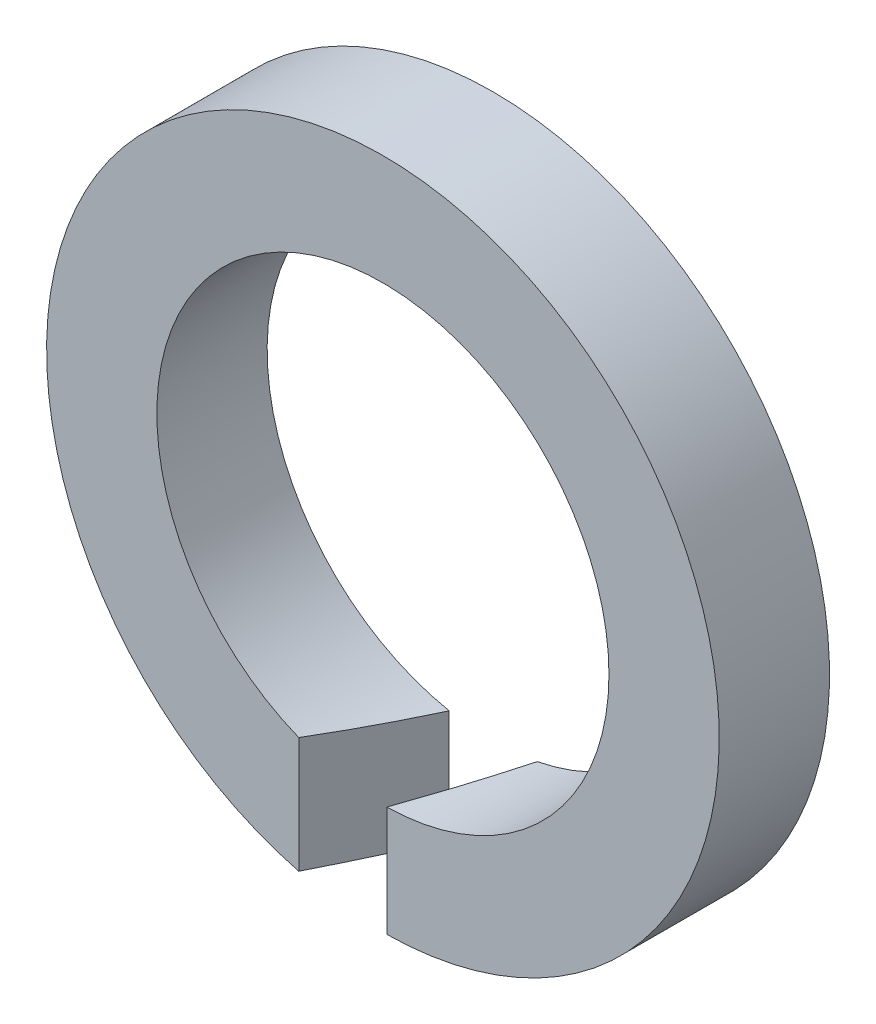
ISO-10303-21;
HEADER;
FILE_DESCRIPTION(('STEP AP214'),'2;1');
FILE_NAME('part.step','',(''),(''),'','','');
FILE_SCHEMA(('AUTOMOTIVE_DESIGN { 1 0 10303 214 1 1 1 1 }'));
ENDSEC;
DATA;
#1=APPLICATION_CONTEXT('core data for automotive mechanical design processes');
#2=APPLICATION_PROTOCOL_DEFINITION('international standard','automotive_design',2000,#1);
#3=PRODUCT_CONTEXT('',#1,'mechanical');
#4=PRODUCT('Part','Part','',(#3));
#5=PRODUCT_RELATED_PRODUCT_CATEGORY('part','',(#4));
#6=PRODUCT_DEFINITION_FORMATION('','',#4);
#7=PRODUCT_DEFINITION_CONTEXT('part definition',#1,'design');
#8=PRODUCT_DEFINITION('design','',#6,#7);
#9=PRODUCT_DEFINITION_SHAPE('','',#8);
#10=(LENGTH_UNIT() NAMED_UNIT(*) SI_UNIT(.MILLI.,.METRE.));
#11=(NAMED_UNIT(*) PLANE_ANGLE_UNIT() SI_UNIT($,.RADIAN.));
#12=(NAMED_UNIT(*) SI_UNIT($,.STERADIAN.) SOLID_ANGLE_UNIT());
#13=UNCERTAINTY_MEASURE_WITH_UNIT(LENGTH_MEASURE(1.E-05),#10,'distance_accuracy_value','');
#14=(GEOMETRIC_REPRESENTATION_CONTEXT(3) GLOBAL_UNCERTAINTY_ASSIGNED_CONTEXT((#13)) GLOBAL_UNIT_ASSIGNED_CONTEXT((#10,
#11,#12)) REPRESENTATION_CONTEXT('',''));
#15=CARTESIAN_POINT('',(0.,0.,0.));
#16=DIRECTION('',(0.,0.,1.));
#17=DIRECTION('',(1.,0.,0.));
#18=AXIS2_PLACEMENT_3D('',#15,#16,#17);
#19=CARTESIAN_POINT('',(0.,0.,2.));
#20=DIRECTION('',(0.,0.,1.));
#21=DIRECTION('',(1.,0.,0.));
#22=AXIS2_PLACEMENT_3D('',#19,#20,#21);
#23=PLANE('',#22);
#24=DIRECTION('',(0.,1.,0.));
#25=VECTOR('',#24,1.);
#26=CARTESIAN_POINT('',(-1.52607379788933,-6.1,2.));
#27=LINE('',#26,#25);
#28=CARTESIAN_POINT('',(-1.52607379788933,-5.90602224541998,2.));
#29=VERTEX_POINT('',#28);
#30=CARTESIAN_POINT('',(-1.52607379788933,-3.80540388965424,2.));
#31=VERTEX_POINT('',#30);
#32=EDGE_CURVE('E74',#29,#31,#27,.T.);
#33=ORIENTED_EDGE('',*,*,#32,.T.);
#34=CARTESIAN_POINT('',(0.,0.,2.));
#35=DIRECTION('',(0.,0.,1.));
#36=DIRECTION('',(1.,0.,0.));
#37=AXIS2_PLACEMENT_3D('',#34,#35,#36);
#38=CIRCLE('',#37,4.1);
#39=CARTESIAN_POINT('',(0.0701928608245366,-4.09939909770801,2.));
#40=VERTEX_POINT('',#39);
#41=EDGE_CURVE('E94',#40,#31,#38,.T.);
#42=ORIENTED_EDGE('',*,*,#41,.F.);
#43=DIRECTION('',(0.,1.,0.));
#44=VECTOR('',#43,1.);
#45=CARTESIAN_POINT('',(0.0701928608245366,-6.1,2.));
#46=LINE('',#45,#44);
#47=CARTESIAN_POINT('',(0.0701928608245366,-6.09959613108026,2.));
#48=VERTEX_POINT('',#47);
#49=EDGE_CURVE('E58',#48,#40,#46,.T.);
#50=ORIENTED_EDGE('',*,*,#49,.F.);
#51=CARTESIAN_POINT('',(0.,0.,2.));
#52=DIRECTION('',(0.,0.,1.));
#53=DIRECTION('',(1.,0.,0.));
#54=AXIS2_PLACEMENT_3D('',#51,#52,#53);
#55=CIRCLE('',#54,6.1);
#56=EDGE_CURVE('E87',#48,#29,#55,.T.);
#57=ORIENTED_EDGE('',*,*,#56,.T.);
#58=EDGE_LOOP('',(#33,#42,#50,#57));
#59=FACE_BOUND('',#58,.T.);
#60=ADVANCED_FACE('F36',(#59),#23,.T.);
#61=CARTESIAN_POINT('',(0.,0.,0.));
#62=DIRECTION('',(0.,0.,1.));
#63=DIRECTION('',(1.,0.,0.));
#64=AXIS2_PLACEMENT_3D('',#61,#62,#63);
#65=PLANE('',#64);
#66=CARTESIAN_POINT('',(0.,0.,0.));
#67=DIRECTION('',(0.,0.,1.));
#68=DIRECTION('',(1.,0.,0.));
#69=AXIS2_PLACEMENT_3D('',#66,#67,#68);
#70=CIRCLE('',#69,4.1);
#71=CARTESIAN_POINT('',(0.798133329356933,-4.02156476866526,0.));
#72=VERTEX_POINT('',#71);
#73=CARTESIAN_POINT('',(-0.798133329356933,-4.02156476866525,0.));
#74=VERTEX_POINT('',#73);
#75=EDGE_CURVE('E90',#72,#74,#70,.T.);
#76=ORIENTED_EDGE('',*,*,#75,.T.);
#77=DIRECTION('',(0.,1.,0.));
#78=VECTOR('',#77,1.);
#79=CARTESIAN_POINT('',(-0.798133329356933,-6.1,0.));
#80=LINE('',#79,#78);
#81=CARTESIAN_POINT('',(-0.798133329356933,-6.04756010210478,0.));
#82=VERTEX_POINT('',#81);
#83=EDGE_CURVE('E50',#82,#74,#80,.T.);
#84=ORIENTED_EDGE('',*,*,#83,.F.);
#85=CARTESIAN_POINT('',(0.,0.,0.));
#86=DIRECTION('',(0.,0.,1.));
#87=DIRECTION('',(1.,0.,0.));
#88=AXIS2_PLACEMENT_3D('',#85,#86,#87);
#89=CIRCLE('',#88,6.1);
#90=CARTESIAN_POINT('',(0.798133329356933,-6.04756010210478,0.));
#91=VERTEX_POINT('',#90);
#92=EDGE_CURVE('E89',#91,#82,#89,.T.);
#93=ORIENTED_EDGE('',*,*,#92,.F.);
#94=DIRECTION('',(0.,1.,0.));
#95=VECTOR('',#94,1.);
#96=CARTESIAN_POINT('',(0.798133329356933,-6.1,0.));
#97=LINE('',#96,#95);
#98=EDGE_CURVE('E103',#91,#72,#97,.T.);
#99=ORIENTED_EDGE('',*,*,#98,.T.);
#100=EDGE_LOOP('',(#76,#84,#93,#99));
#101=FACE_BOUND('',#100,.T.);
#102=ADVANCED_FACE('F108',(#101),#65,.F.);
#103=CARTESIAN_POINT('',(0.,0.,2.));
#104=DIRECTION('',(0.,0.,-1.));
#105=DIRECTION('',(-1.,0.,0.));
#106=AXIS2_PLACEMENT_3D('',#103,#104,#105);
#107=CYLINDRICAL_SURFACE('',#106,6.1);
#108=ORIENTED_EDGE('',*,*,#92,.T.);
#109=CARTESIAN_POINT('',(0.,0.,-2.19285330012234));
#110=DIRECTION('',(-0.939692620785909,0.,-0.342020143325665));
#111=DIRECTION('',(0.342020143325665,0.,-0.93969262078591));
#112=AXIS2_PLACEMENT_3D('',#109,#110,#111);
#113=ELLIPSE('',#112,17.835206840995,6.1);
#114=EDGE_CURVE('E77',#82,#29,#113,.T.);
#115=ORIENTED_EDGE('',*,*,#114,.T.);
#116=ORIENTED_EDGE('',*,*,#56,.F.);
#117=CARTESIAN_POINT('',(0.,0.,2.19285330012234));
#118=DIRECTION('',(0.939692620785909,0.,0.342020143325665));
#119=DIRECTION('',(0.342020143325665,0.,-0.93969262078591));
#120=AXIS2_PLACEMENT_3D('',#117,#118,#119);
#121=ELLIPSE('',#120,17.835206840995,6.1);
#122=EDGE_CURVE('E91',#48,#91,#121,.T.);
#123=ORIENTED_EDGE('',*,*,#122,.T.);
#124=EDGE_LOOP('',(#108,#115,#116,#123));
#125=FACE_BOUND('',#124,.T.);
#126=ADVANCED_FACE('F38',(#125),#107,.T.);
#127=CARTESIAN_POINT('',(0.,0.,2.));
#128=DIRECTION('',(0.,0.,-1.));
#129=DIRECTION('',(-1.,0.,0.));
#130=AXIS2_PLACEMENT_3D('',#127,#128,#129);
#131=CYLINDRICAL_SURFACE('',#130,4.1);
#132=CARTESIAN_POINT('',(0.,0.,-2.19285330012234));
#133=DIRECTION('',(-0.939692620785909,0.,-0.342020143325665));
#134=DIRECTION('',(0.342020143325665,0.,-0.93969262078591));
#135=AXIS2_PLACEMENT_3D('',#132,#133,#134);
#136=ELLIPSE('',#135,11.9875980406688,4.1);
#137=EDGE_CURVE('E11',#74,#31,#136,.T.);
#138=ORIENTED_EDGE('',*,*,#137,.F.);
#139=ORIENTED_EDGE('',*,*,#75,.F.);
#140=CARTESIAN_POINT('',(0.,0.,2.19285330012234));
#141=DIRECTION('',(0.939692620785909,0.,0.342020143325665));
#142=DIRECTION('',(0.342020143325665,0.,-0.93969262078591));
#143=AXIS2_PLACEMENT_3D('',#140,#141,#142);
#144=ELLIPSE('',#143,11.9875980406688,4.1);
#145=EDGE_CURVE('E44',#40,#72,#144,.T.);
#146=ORIENTED_EDGE('',*,*,#145,.F.);
#147=ORIENTED_EDGE('',*,*,#41,.T.);
#148=EDGE_LOOP('',(#138,#139,#146,#147));
#149=FACE_BOUND('',#148,.T.);
#150=ADVANCED_FACE('F110',(#149),#131,.F.);
#151=CARTESIAN_POINT('',(0.798133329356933,-6.1,0.));
#152=DIRECTION('',(0.939692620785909,0.,0.342020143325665));
#153=DIRECTION('',(0.342020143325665,0.,-0.93969262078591));
#154=AXIS2_PLACEMENT_3D('',#151,#152,#153);
#155=PLANE('',#154);
#156=ORIENTED_EDGE('',*,*,#49,.T.);
#157=ORIENTED_EDGE('',*,*,#145,.T.);
#158=ORIENTED_EDGE('',*,*,#98,.F.);
#159=ORIENTED_EDGE('',*,*,#122,.F.);
#160=EDGE_LOOP('',(#156,#157,#158,#159));
#161=FACE_BOUND('',#160,.T.);
#162=ADVANCED_FACE('F111',(#161),#155,.F.);
#163=CARTESIAN_POINT('',(-0.798133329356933,-6.1,0.));
#164=DIRECTION('',(-0.939692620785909,0.,-0.342020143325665));
#165=DIRECTION('',(-0.342020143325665,0.,0.93969262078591));
#166=AXIS2_PLACEMENT_3D('',#163,#164,#165);
#167=PLANE('',#166);
#168=ORIENTED_EDGE('',*,*,#83,.T.);
#169=ORIENTED_EDGE('',*,*,#137,.T.);
#170=ORIENTED_EDGE('',*,*,#32,.F.);
#171=ORIENTED_EDGE('',*,*,#114,.F.);
#172=EDGE_LOOP('',(#168,#169,#170,#171));
#173=FACE_BOUND('',#172,.T.);
#174=ADVANCED_FACE('F76',(#173),#167,.F.);
#175=CLOSED_SHELL('',(#60,#102,#126,#150,#162,#174));
#176=MANIFOLD_SOLID_BREP('B2',#175);
#177=ADVANCED_BREP_SHAPE_REPRESENTATION('',(#18,#176),#14);
#178=SHAPE_DEFINITION_REPRESENTATION(#9,#177);
ENDSEC;
END-ISO-10303-21;
